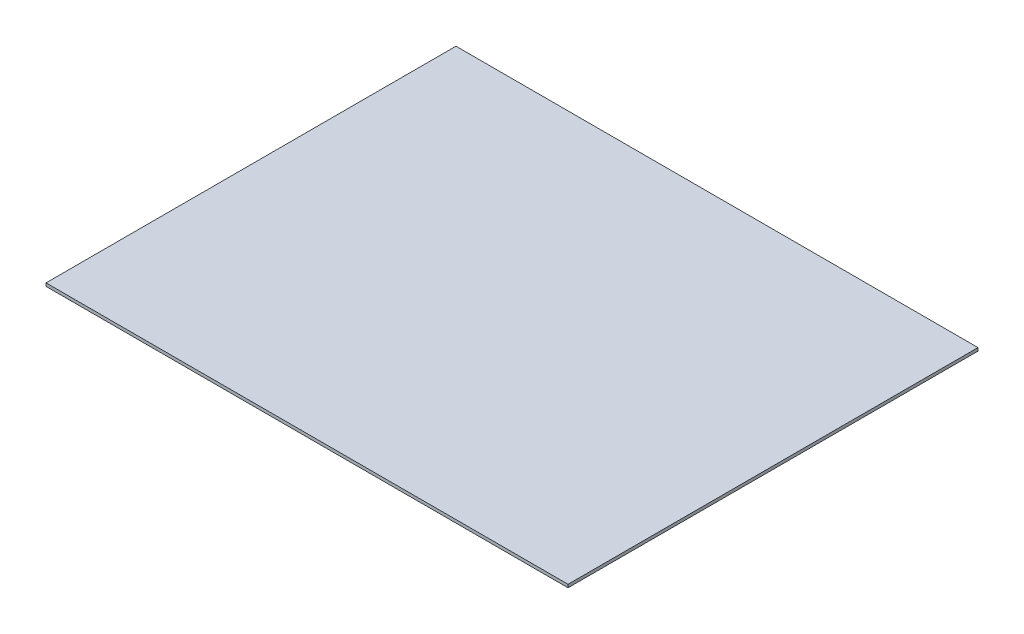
from build123d import *

# Parameters (mm, degrees)
SKETCH1_W           = 340
SKETCH1_H           = 267
BOSS_EXTRUDE1_DEPTH = 2


with BuildPart() as part:
    # Sketch1 → Boss-Extrude1 (new body)
    with BuildSketch(Plane(origin=(0, 0, 0), x_dir=(1, 0, 0), z_dir=(0, 1, 0))):
        Rectangle(SKETCH1_W, SKETCH1_H)
    extrude(amount=BOSS_EXTRUDE1_DEPTH)


solid = part.part
